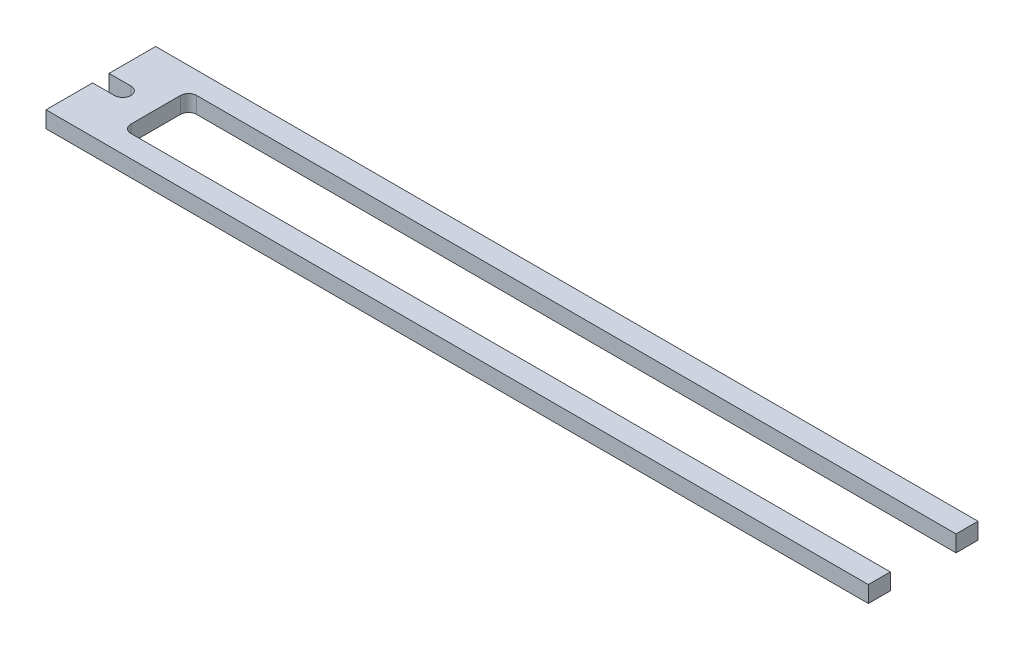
ISO-10303-21;
HEADER;
FILE_DESCRIPTION(('STEP AP214'),'2;1');
FILE_NAME('part.step','',(''),(''),'','','');
FILE_SCHEMA(('AUTOMOTIVE_DESIGN { 1 0 10303 214 1 1 1 1 }'));
ENDSEC;
DATA;
#1=APPLICATION_CONTEXT('core data for automotive mechanical design processes');
#2=APPLICATION_PROTOCOL_DEFINITION('international standard','automotive_design',2000,#1);
#3=PRODUCT_CONTEXT('',#1,'mechanical');
#4=PRODUCT('Part','Part','',(#3));
#5=PRODUCT_RELATED_PRODUCT_CATEGORY('part','',(#4));
#6=PRODUCT_DEFINITION_FORMATION('','',#4);
#7=PRODUCT_DEFINITION_CONTEXT('part definition',#1,'design');
#8=PRODUCT_DEFINITION('design','',#6,#7);
#9=PRODUCT_DEFINITION_SHAPE('','',#8);
#10=(LENGTH_UNIT() NAMED_UNIT(*) SI_UNIT(.MILLI.,.METRE.));
#11=(NAMED_UNIT(*) PLANE_ANGLE_UNIT() SI_UNIT($,.RADIAN.));
#12=(NAMED_UNIT(*) SI_UNIT($,.STERADIAN.) SOLID_ANGLE_UNIT());
#13=UNCERTAINTY_MEASURE_WITH_UNIT(LENGTH_MEASURE(1.E-05),#10,'distance_accuracy_value','');
#14=(GEOMETRIC_REPRESENTATION_CONTEXT(3) GLOBAL_UNCERTAINTY_ASSIGNED_CONTEXT((#13)) GLOBAL_UNIT_ASSIGNED_CONTEXT((#10,
#11,#12)) REPRESENTATION_CONTEXT('',''));
#15=CARTESIAN_POINT('',(0.,0.,0.));
#16=DIRECTION('',(0.,0.,1.));
#17=DIRECTION('',(1.,0.,0.));
#18=AXIS2_PLACEMENT_3D('',#15,#16,#17);
#19=CARTESIAN_POINT('',(-23.0142791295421,1.5,-5.75));
#20=DIRECTION('',(1.,0.,0.));
#21=DIRECTION('',(0.,0.,-1.));
#22=AXIS2_PLACEMENT_3D('',#19,#20,#21);
#23=PLANE('',#22);
#24=DIRECTION('',(0.,0.,1.));
#25=VECTOR('',#24,1.);
#26=CARTESIAN_POINT('',(-23.0142791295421,0.,-5.75));
#27=LINE('',#26,#25);
#28=CARTESIAN_POINT('',(-23.0142791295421,0.,-5.75));
#29=VERTEX_POINT('',#28);
#30=CARTESIAN_POINT('',(-23.0142791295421,0.,-1.5));
#31=VERTEX_POINT('',#30);
#32=EDGE_CURVE('E167',#29,#31,#27,.T.);
#33=ORIENTED_EDGE('',*,*,#32,.T.);
#34=DIRECTION('',(0.,-1.,0.));
#35=VECTOR('',#34,1.);
#36=CARTESIAN_POINT('',(-23.0142791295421,1.5,-1.5));
#37=LINE('',#36,#35);
#38=CARTESIAN_POINT('',(-23.0142791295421,1.5,-1.5));
#39=VERTEX_POINT('',#38);
#40=EDGE_CURVE('E11',#39,#31,#37,.T.);
#41=ORIENTED_EDGE('',*,*,#40,.F.);
#42=DIRECTION('',(0.,0.,1.));
#43=VECTOR('',#42,1.);
#44=CARTESIAN_POINT('',(-23.0142791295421,1.5,-5.75));
#45=LINE('',#44,#43);
#46=CARTESIAN_POINT('',(-23.0142791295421,1.5,-5.75));
#47=VERTEX_POINT('',#46);
#48=EDGE_CURVE('E193',#47,#39,#45,.T.);
#49=ORIENTED_EDGE('',*,*,#48,.F.);
#50=DIRECTION('',(0.,-1.,0.));
#51=VECTOR('',#50,1.);
#52=CARTESIAN_POINT('',(-23.0142791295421,1.5,-5.75));
#53=LINE('',#52,#51);
#54=EDGE_CURVE('E163',#47,#29,#53,.T.);
#55=ORIENTED_EDGE('',*,*,#54,.T.);
#56=EDGE_LOOP('',(#33,#41,#49,#55));
#57=FACE_BOUND('',#56,.T.);
#58=ADVANCED_FACE('F35',(#57),#23,.F.);
#59=CARTESIAN_POINT('',(-23.0142791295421,1.5,-1.5));
#60=DIRECTION('',(0.,0.,-1.));
#61=DIRECTION('',(-1.,0.,0.));
#62=AXIS2_PLACEMENT_3D('',#59,#60,#61);
#63=PLANE('',#62);
#64=DIRECTION('',(1.,0.,0.));
#65=VECTOR('',#64,1.);
#66=CARTESIAN_POINT('',(-23.0142791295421,0.,-1.5));
#67=LINE('',#66,#65);
#68=CARTESIAN_POINT('',(-21.0142791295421,0.,-1.5));
#69=VERTEX_POINT('',#68);
#70=EDGE_CURVE('E170',#31,#69,#67,.T.);
#71=ORIENTED_EDGE('',*,*,#70,.T.);
#72=DIRECTION('',(0.,-1.,0.));
#73=VECTOR('',#72,1.);
#74=CARTESIAN_POINT('',(-21.0142791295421,1.5,-1.5));
#75=LINE('',#74,#73);
#76=CARTESIAN_POINT('',(-21.0142791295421,1.5,-1.5));
#77=VERTEX_POINT('',#76);
#78=EDGE_CURVE('E43',#77,#69,#75,.T.);
#79=ORIENTED_EDGE('',*,*,#78,.F.);
#80=DIRECTION('',(1.,0.,0.));
#81=VECTOR('',#80,1.);
#82=CARTESIAN_POINT('',(-23.0142791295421,1.5,-1.5));
#83=LINE('',#82,#81);
#84=EDGE_CURVE('E112',#39,#77,#83,.T.);
#85=ORIENTED_EDGE('',*,*,#84,.F.);
#86=ORIENTED_EDGE('',*,*,#40,.T.);
#87=EDGE_LOOP('',(#71,#79,#85,#86));
#88=FACE_BOUND('',#87,.T.);
#89=ADVANCED_FACE('F281',(#88),#63,.F.);
#90=CARTESIAN_POINT('',(-21.0142791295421,1.5,-0.75));
#91=DIRECTION('',(0.,-1.,0.));
#92=DIRECTION('',(0.,0.,-1.));
#93=AXIS2_PLACEMENT_3D('',#90,#91,#92);
#94=CYLINDRICAL_SURFACE('',#93,0.75);
#95=CARTESIAN_POINT('',(-21.0142791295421,0.,-0.75));
#96=DIRECTION('',(0.,-1.,0.));
#97=DIRECTION('',(0.,0.,-1.));
#98=AXIS2_PLACEMENT_3D('',#95,#96,#97);
#99=CIRCLE('',#98,0.75);
#100=CARTESIAN_POINT('',(-21.0142791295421,0.,0.));
#101=VERTEX_POINT('',#100);
#102=EDGE_CURVE('E172',#69,#101,#99,.T.);
#103=ORIENTED_EDGE('',*,*,#102,.T.);
#104=DIRECTION('',(0.,-1.,0.));
#105=VECTOR('',#104,1.);
#106=CARTESIAN_POINT('',(-21.0142791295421,1.5,0.));
#107=LINE('',#106,#105);
#108=CARTESIAN_POINT('',(-21.0142791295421,1.5,0.));
#109=VERTEX_POINT('',#108);
#110=EDGE_CURVE('E218',#109,#101,#107,.T.);
#111=ORIENTED_EDGE('',*,*,#110,.F.);
#112=CARTESIAN_POINT('',(-21.0142791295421,1.5,-0.75));
#113=DIRECTION('',(0.,-1.,0.));
#114=DIRECTION('',(0.,0.,-1.));
#115=AXIS2_PLACEMENT_3D('',#112,#113,#114);
#116=CIRCLE('',#115,0.75);
#117=EDGE_CURVE('E226',#77,#109,#116,.T.);
#118=ORIENTED_EDGE('',*,*,#117,.F.);
#119=ORIENTED_EDGE('',*,*,#78,.T.);
#120=EDGE_LOOP('',(#103,#111,#118,#119));
#121=FACE_BOUND('',#120,.T.);
#122=ADVANCED_FACE('F224',(#121),#94,.F.);
#123=CARTESIAN_POINT('',(-21.0142791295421,1.5,0.));
#124=DIRECTION('',(0.,0.,1.));
#125=DIRECTION('',(1.,0.,0.));
#126=AXIS2_PLACEMENT_3D('',#123,#124,#125);
#127=PLANE('',#126);
#128=DIRECTION('',(-1.,0.,0.));
#129=VECTOR('',#128,1.);
#130=CARTESIAN_POINT('',(-21.0142791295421,0.,0.));
#131=LINE('',#130,#129);
#132=CARTESIAN_POINT('',(-23.0142791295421,0.,0.));
#133=VERTEX_POINT('',#132);
#134=EDGE_CURVE('E174',#101,#133,#131,.T.);
#135=ORIENTED_EDGE('',*,*,#134,.T.);
#136=DIRECTION('',(0.,-1.,0.));
#137=VECTOR('',#136,1.);
#138=CARTESIAN_POINT('',(-23.0142791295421,1.5,0.));
#139=LINE('',#138,#137);
#140=CARTESIAN_POINT('',(-23.0142791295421,1.5,0.));
#141=VERTEX_POINT('',#140);
#142=EDGE_CURVE('E215',#141,#133,#139,.T.);
#143=ORIENTED_EDGE('',*,*,#142,.F.);
#144=DIRECTION('',(-1.,0.,0.));
#145=VECTOR('',#144,1.);
#146=CARTESIAN_POINT('',(-21.0142791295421,1.5,0.));
#147=LINE('',#146,#145);
#148=EDGE_CURVE('E244',#109,#141,#147,.T.);
#149=ORIENTED_EDGE('',*,*,#148,.F.);
#150=ORIENTED_EDGE('',*,*,#110,.T.);
#151=EDGE_LOOP('',(#135,#143,#149,#150));
#152=FACE_BOUND('',#151,.T.);
#153=ADVANCED_FACE('F235',(#152),#127,.F.);
#154=CARTESIAN_POINT('',(-23.0142791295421,1.5,0.));
#155=DIRECTION('',(1.,0.,0.));
#156=DIRECTION('',(0.,0.,-1.));
#157=AXIS2_PLACEMENT_3D('',#154,#155,#156);
#158=PLANE('',#157);
#159=DIRECTION('',(0.,0.,1.));
#160=VECTOR('',#159,1.);
#161=CARTESIAN_POINT('',(-23.0142791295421,0.,0.));
#162=LINE('',#161,#160);
#163=CARTESIAN_POINT('',(-23.0142791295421,0.,4.25));
#164=VERTEX_POINT('',#163);
#165=EDGE_CURVE('E176',#133,#164,#162,.T.);
#166=ORIENTED_EDGE('',*,*,#165,.T.);
#167=DIRECTION('',(0.,-1.,0.));
#168=VECTOR('',#167,1.);
#169=CARTESIAN_POINT('',(-23.0142791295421,1.5,4.25));
#170=LINE('',#169,#168);
#171=CARTESIAN_POINT('',(-23.0142791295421,1.5,4.25));
#172=VERTEX_POINT('',#171);
#173=EDGE_CURVE('E212',#172,#164,#170,.T.);
#174=ORIENTED_EDGE('',*,*,#173,.F.);
#175=DIRECTION('',(0.,0.,1.));
#176=VECTOR('',#175,1.);
#177=CARTESIAN_POINT('',(-23.0142791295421,1.5,0.));
#178=LINE('',#177,#176);
#179=EDGE_CURVE('E241',#141,#172,#178,.T.);
#180=ORIENTED_EDGE('',*,*,#179,.F.);
#181=ORIENTED_EDGE('',*,*,#142,.T.);
#182=EDGE_LOOP('',(#166,#174,#180,#181));
#183=FACE_BOUND('',#182,.T.);
#184=ADVANCED_FACE('F239',(#183),#158,.F.);
#185=CARTESIAN_POINT('',(-23.0142791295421,1.5,4.25));
#186=DIRECTION('',(0.,0.,-1.));
#187=DIRECTION('',(-1.,0.,0.));
#188=AXIS2_PLACEMENT_3D('',#185,#186,#187);
#189=PLANE('',#188);
#190=DIRECTION('',(1.,0.,0.));
#191=VECTOR('',#190,1.);
#192=CARTESIAN_POINT('',(-23.0142791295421,0.,4.25));
#193=LINE('',#192,#191);
#194=CARTESIAN_POINT('',(51.9857208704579,0.,4.25));
#195=VERTEX_POINT('',#194);
#196=EDGE_CURVE('E178',#164,#195,#193,.T.);
#197=ORIENTED_EDGE('',*,*,#196,.T.);
#198=DIRECTION('',(0.,-1.,0.));
#199=VECTOR('',#198,1.);
#200=CARTESIAN_POINT('',(51.9857208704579,1.5,4.25));
#201=LINE('',#200,#199);
#202=CARTESIAN_POINT('',(51.9857208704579,1.5,4.25));
#203=VERTEX_POINT('',#202);
#204=EDGE_CURVE('E209',#203,#195,#201,.T.);
#205=ORIENTED_EDGE('',*,*,#204,.F.);
#206=DIRECTION('',(1.,0.,0.));
#207=VECTOR('',#206,1.);
#208=CARTESIAN_POINT('',(-23.0142791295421,1.5,4.25));
#209=LINE('',#208,#207);
#210=EDGE_CURVE('E243',#172,#203,#209,.T.);
#211=ORIENTED_EDGE('',*,*,#210,.F.);
#212=ORIENTED_EDGE('',*,*,#173,.T.);
#213=EDGE_LOOP('',(#197,#205,#211,#212));
#214=FACE_BOUND('',#213,.T.);
#215=ADVANCED_FACE('F294',(#214),#189,.F.);
#216=CARTESIAN_POINT('',(51.9857208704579,1.5,2.25));
#217=DIRECTION('',(-1.,0.,0.));
#218=DIRECTION('',(0.,0.,1.));
#219=AXIS2_PLACEMENT_3D('',#216,#217,#218);
#220=PLANE('',#219);
#221=DIRECTION('',(0.,0.,-1.));
#222=VECTOR('',#221,1.);
#223=CARTESIAN_POINT('',(51.9857208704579,0.,2.25));
#224=LINE('',#223,#222);
#225=CARTESIAN_POINT('',(51.9857208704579,0.,2.25));
#226=VERTEX_POINT('',#225);
#227=EDGE_CURVE('E180',#195,#226,#224,.T.);
#228=ORIENTED_EDGE('',*,*,#227,.T.);
#229=DIRECTION('',(0.,-1.,0.));
#230=VECTOR('',#229,1.);
#231=CARTESIAN_POINT('',(51.9857208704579,1.5,2.25));
#232=LINE('',#231,#230);
#233=CARTESIAN_POINT('',(51.9857208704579,1.5,2.25));
#234=VERTEX_POINT('',#233);
#235=EDGE_CURVE('E206',#234,#226,#232,.T.);
#236=ORIENTED_EDGE('',*,*,#235,.F.);
#237=DIRECTION('',(0.,0.,-1.));
#238=VECTOR('',#237,1.);
#239=CARTESIAN_POINT('',(51.9857208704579,1.5,2.25));
#240=LINE('',#239,#238);
#241=EDGE_CURVE('E246',#203,#234,#240,.T.);
#242=ORIENTED_EDGE('',*,*,#241,.F.);
#243=ORIENTED_EDGE('',*,*,#204,.T.);
#244=EDGE_LOOP('',(#228,#236,#242,#243));
#245=FACE_BOUND('',#244,.T.);
#246=ADVANCED_FACE('F297',(#245),#220,.F.);
#247=CARTESIAN_POINT('',(51.9857208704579,1.5,2.25));
#248=DIRECTION('',(0.,0.,1.));
#249=DIRECTION('',(1.,0.,0.));
#250=AXIS2_PLACEMENT_3D('',#247,#248,#249);
#251=PLANE('',#250);
#252=DIRECTION('',(-1.,0.,0.));
#253=VECTOR('',#252,1.);
#254=CARTESIAN_POINT('',(51.9857208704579,0.,2.25));
#255=LINE('',#254,#253);
#256=CARTESIAN_POINT('',(-17.274279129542,0.,2.25000000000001));
#257=VERTEX_POINT('',#256);
#258=EDGE_CURVE('E182',#226,#257,#255,.T.);
#259=ORIENTED_EDGE('',*,*,#258,.T.);
#260=DIRECTION('',(0.,-1.,0.));
#261=VECTOR('',#260,1.);
#262=CARTESIAN_POINT('',(-17.274279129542,1.5,2.25000000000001));
#263=LINE('',#262,#261);
#264=CARTESIAN_POINT('',(-17.274279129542,1.5,2.25000000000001));
#265=VERTEX_POINT('',#264);
#266=EDGE_CURVE('E203',#265,#257,#263,.T.);
#267=ORIENTED_EDGE('',*,*,#266,.F.);
#268=DIRECTION('',(-1.,0.,0.));
#269=VECTOR('',#268,1.);
#270=CARTESIAN_POINT('',(51.9857208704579,1.5,2.25));
#271=LINE('',#270,#269);
#272=EDGE_CURVE('E252',#234,#265,#271,.T.);
#273=ORIENTED_EDGE('',*,*,#272,.F.);
#274=ORIENTED_EDGE('',*,*,#235,.T.);
#275=EDGE_LOOP('',(#259,#267,#273,#274));
#276=FACE_BOUND('',#275,.T.);
#277=ADVANCED_FACE('F301',(#276),#251,.F.);
#278=CARTESIAN_POINT('',(-17.274279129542,1.5,1.51000000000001));
#279=DIRECTION('',(0.,-1.,0.));
#280=DIRECTION('',(0.,0.,-1.));
#281=AXIS2_PLACEMENT_3D('',#278,#279,#280);
#282=CYLINDRICAL_SURFACE('',#281,0.740000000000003);
#283=CARTESIAN_POINT('',(-17.274279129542,0.,1.51000000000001));
#284=DIRECTION('',(0.,-1.,0.));
#285=DIRECTION('',(0.,0.,-1.));
#286=AXIS2_PLACEMENT_3D('',#283,#284,#285);
#287=CIRCLE('',#286,0.740000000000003);
#288=CARTESIAN_POINT('',(-18.0142791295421,0.,1.51000000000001));
#289=VERTEX_POINT('',#288);
#290=EDGE_CURVE('E184',#257,#289,#287,.T.);
#291=ORIENTED_EDGE('',*,*,#290,.T.);
#292=DIRECTION('',(0.,-1.,0.));
#293=VECTOR('',#292,1.);
#294=CARTESIAN_POINT('',(-18.0142791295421,1.5,1.51000000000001));
#295=LINE('',#294,#293);
#296=CARTESIAN_POINT('',(-18.0142791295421,1.5,1.51000000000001));
#297=VERTEX_POINT('',#296);
#298=EDGE_CURVE('E200',#297,#289,#295,.T.);
#299=ORIENTED_EDGE('',*,*,#298,.F.);
#300=CARTESIAN_POINT('',(-17.274279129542,1.5,1.51000000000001));
#301=DIRECTION('',(0.,-1.,0.));
#302=DIRECTION('',(0.,0.,-1.));
#303=AXIS2_PLACEMENT_3D('',#300,#301,#302);
#304=CIRCLE('',#303,0.740000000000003);
#305=EDGE_CURVE('E254',#265,#297,#304,.T.);
#306=ORIENTED_EDGE('',*,*,#305,.F.);
#307=ORIENTED_EDGE('',*,*,#266,.T.);
#308=EDGE_LOOP('',(#291,#299,#306,#307));
#309=FACE_BOUND('',#308,.T.);
#310=ADVANCED_FACE('F305',(#309),#282,.F.);
#311=CARTESIAN_POINT('',(-18.014279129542,1.5,-3.00999999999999));
#312=DIRECTION('',(-1.,0.,0.));
#313=DIRECTION('',(0.,0.,1.));
#314=AXIS2_PLACEMENT_3D('',#311,#312,#313);
#315=PLANE('',#314);
#316=DIRECTION('',(0.,0.,-1.));
#317=VECTOR('',#316,1.);
#318=CARTESIAN_POINT('',(-18.014279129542,0.,-3.00999999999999));
#319=LINE('',#318,#317);
#320=CARTESIAN_POINT('',(-18.014279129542,0.,-3.00999999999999));
#321=VERTEX_POINT('',#320);
#322=EDGE_CURVE('E186',#289,#321,#319,.T.);
#323=ORIENTED_EDGE('',*,*,#322,.T.);
#324=DIRECTION('',(0.,-1.,0.));
#325=VECTOR('',#324,1.);
#326=CARTESIAN_POINT('',(-18.014279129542,1.5,-3.00999999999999));
#327=LINE('',#326,#325);
#328=CARTESIAN_POINT('',(-18.014279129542,1.5,-3.00999999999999));
#329=VERTEX_POINT('',#328);
#330=EDGE_CURVE('E197',#329,#321,#327,.T.);
#331=ORIENTED_EDGE('',*,*,#330,.F.);
#332=DIRECTION('',(0.,0.,-1.));
#333=VECTOR('',#332,1.);
#334=CARTESIAN_POINT('',(-18.014279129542,1.5,-3.00999999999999));
#335=LINE('',#334,#333);
#336=EDGE_CURVE('E256',#297,#329,#335,.T.);
#337=ORIENTED_EDGE('',*,*,#336,.F.);
#338=ORIENTED_EDGE('',*,*,#298,.T.);
#339=EDGE_LOOP('',(#323,#331,#337,#338));
#340=FACE_BOUND('',#339,.T.);
#341=ADVANCED_FACE('F262',(#340),#315,.F.);
#342=CARTESIAN_POINT('',(-17.274279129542,1.5,-3.00999999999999));
#343=DIRECTION('',(0.,-1.,0.));
#344=DIRECTION('',(0.,0.,-1.));
#345=AXIS2_PLACEMENT_3D('',#342,#343,#344);
#346=CYLINDRICAL_SURFACE('',#345,0.740000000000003);
#347=CARTESIAN_POINT('',(-17.274279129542,0.,-3.00999999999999));
#348=DIRECTION('',(0.,-1.,0.));
#349=DIRECTION('',(0.,0.,1.));
#350=AXIS2_PLACEMENT_3D('',#347,#348,#349);
#351=CIRCLE('',#350,0.740000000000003);
#352=CARTESIAN_POINT('',(-17.274279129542,0.,-3.74999999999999));
#353=VERTEX_POINT('',#352);
#354=EDGE_CURVE('E188',#321,#353,#351,.T.);
#355=ORIENTED_EDGE('',*,*,#354,.T.);
#356=DIRECTION('',(0.,-1.,0.));
#357=VECTOR('',#356,1.);
#358=CARTESIAN_POINT('',(-17.274279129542,1.5,-3.74999999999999));
#359=LINE('',#358,#357);
#360=CARTESIAN_POINT('',(-17.274279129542,1.5,-3.74999999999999));
#361=VERTEX_POINT('',#360);
#362=EDGE_CURVE('E158',#361,#353,#359,.T.);
#363=ORIENTED_EDGE('',*,*,#362,.F.);
#364=CARTESIAN_POINT('',(-17.274279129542,1.5,-3.00999999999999));
#365=DIRECTION('',(0.,-1.,0.));
#366=DIRECTION('',(0.,0.,1.));
#367=AXIS2_PLACEMENT_3D('',#364,#365,#366);
#368=CIRCLE('',#367,0.740000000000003);
#369=EDGE_CURVE('E149',#329,#361,#368,.T.);
#370=ORIENTED_EDGE('',*,*,#369,.F.);
#371=ORIENTED_EDGE('',*,*,#330,.T.);
#372=EDGE_LOOP('',(#355,#363,#370,#371));
#373=FACE_BOUND('',#372,.T.);
#374=ADVANCED_FACE('F266',(#373),#346,.F.);
#375=CARTESIAN_POINT('',(51.9857208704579,1.5,-3.75));
#376=DIRECTION('',(0.,0.,-1.));
#377=DIRECTION('',(-1.,0.,0.));
#378=AXIS2_PLACEMENT_3D('',#375,#376,#377);
#379=PLANE('',#378);
#380=DIRECTION('',(1.,0.,0.));
#381=VECTOR('',#380,1.);
#382=CARTESIAN_POINT('',(51.9857208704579,0.,-3.75));
#383=LINE('',#382,#381);
#384=CARTESIAN_POINT('',(51.9857208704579,0.,-3.75));
#385=VERTEX_POINT('',#384);
#386=EDGE_CURVE('E157',#353,#385,#383,.T.);
#387=ORIENTED_EDGE('',*,*,#386,.T.);
#388=DIRECTION('',(0.,-1.,0.));
#389=VECTOR('',#388,1.);
#390=CARTESIAN_POINT('',(51.9857208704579,1.5,-3.75));
#391=LINE('',#390,#389);
#392=CARTESIAN_POINT('',(51.9857208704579,1.5,-3.75));
#393=VERTEX_POINT('',#392);
#394=EDGE_CURVE('E154',#393,#385,#391,.T.);
#395=ORIENTED_EDGE('',*,*,#394,.F.);
#396=DIRECTION('',(1.,0.,0.));
#397=VECTOR('',#396,1.);
#398=CARTESIAN_POINT('',(51.9857208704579,1.5,-3.75));
#399=LINE('',#398,#397);
#400=EDGE_CURVE('E143',#361,#393,#399,.T.);
#401=ORIENTED_EDGE('',*,*,#400,.F.);
#402=ORIENTED_EDGE('',*,*,#362,.T.);
#403=EDGE_LOOP('',(#387,#395,#401,#402));
#404=FACE_BOUND('',#403,.T.);
#405=ADVANCED_FACE('F155',(#404),#379,.F.);
#406=CARTESIAN_POINT('',(51.9857208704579,1.5,-5.75));
#407=DIRECTION('',(-1.,0.,0.));
#408=DIRECTION('',(0.,0.,1.));
#409=AXIS2_PLACEMENT_3D('',#406,#407,#408);
#410=PLANE('',#409);
#411=DIRECTION('',(0.,0.,-1.));
#412=VECTOR('',#411,1.);
#413=CARTESIAN_POINT('',(51.9857208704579,0.,-5.75));
#414=LINE('',#413,#412);
#415=CARTESIAN_POINT('',(51.9857208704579,0.,-5.75));
#416=VERTEX_POINT('',#415);
#417=EDGE_CURVE('E98',#385,#416,#414,.T.);
#418=ORIENTED_EDGE('',*,*,#417,.T.);
#419=DIRECTION('',(0.,-1.,0.));
#420=VECTOR('',#419,1.);
#421=CARTESIAN_POINT('',(51.9857208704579,1.5,-5.75));
#422=LINE('',#421,#420);
#423=CARTESIAN_POINT('',(51.9857208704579,1.5,-5.75));
#424=VERTEX_POINT('',#423);
#425=EDGE_CURVE('E159',#424,#416,#422,.T.);
#426=ORIENTED_EDGE('',*,*,#425,.F.);
#427=DIRECTION('',(0.,0.,-1.));
#428=VECTOR('',#427,1.);
#429=CARTESIAN_POINT('',(51.9857208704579,1.5,-5.75));
#430=LINE('',#429,#428);
#431=EDGE_CURVE('E147',#393,#424,#430,.T.);
#432=ORIENTED_EDGE('',*,*,#431,.F.);
#433=ORIENTED_EDGE('',*,*,#394,.T.);
#434=EDGE_LOOP('',(#418,#426,#432,#433));
#435=FACE_BOUND('',#434,.T.);
#436=ADVANCED_FACE('F161',(#435),#410,.F.);
#437=CARTESIAN_POINT('',(-23.0142791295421,1.5,-5.75));
#438=DIRECTION('',(0.,0.,1.));
#439=DIRECTION('',(1.,0.,0.));
#440=AXIS2_PLACEMENT_3D('',#437,#438,#439);
#441=PLANE('',#440);
#442=DIRECTION('',(-1.,0.,0.));
#443=VECTOR('',#442,1.);
#444=CARTESIAN_POINT('',(-23.0142791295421,0.,-5.75));
#445=LINE('',#444,#443);
#446=EDGE_CURVE('E104',#416,#29,#445,.T.);
#447=ORIENTED_EDGE('',*,*,#446,.T.);
#448=ORIENTED_EDGE('',*,*,#54,.F.);
#449=DIRECTION('',(-1.,0.,0.));
#450=VECTOR('',#449,1.);
#451=CARTESIAN_POINT('',(-23.0142791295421,1.5,-5.75));
#452=LINE('',#451,#450);
#453=EDGE_CURVE('E51',#424,#47,#452,.T.);
#454=ORIENTED_EDGE('',*,*,#453,.F.);
#455=ORIENTED_EDGE('',*,*,#425,.T.);
#456=EDGE_LOOP('',(#447,#448,#454,#455));
#457=FACE_BOUND('',#456,.T.);
#458=ADVANCED_FACE('F270',(#457),#441,.F.);
#459=CARTESIAN_POINT('',(-21.0142791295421,1.5,-0.75));
#460=DIRECTION('',(0.,-1.,0.));
#461=DIRECTION('',(0.,0.,-1.));
#462=AXIS2_PLACEMENT_3D('',#459,#460,#461);
#463=PLANE('',#462);
#464=ORIENTED_EDGE('',*,*,#48,.T.);
#465=ORIENTED_EDGE('',*,*,#84,.T.);
#466=ORIENTED_EDGE('',*,*,#117,.T.);
#467=ORIENTED_EDGE('',*,*,#148,.T.);
#468=ORIENTED_EDGE('',*,*,#179,.T.);
#469=ORIENTED_EDGE('',*,*,#210,.T.);
#470=ORIENTED_EDGE('',*,*,#241,.T.);
#471=ORIENTED_EDGE('',*,*,#272,.T.);
#472=ORIENTED_EDGE('',*,*,#305,.T.);
#473=ORIENTED_EDGE('',*,*,#336,.T.);
#474=ORIENTED_EDGE('',*,*,#369,.T.);
#475=ORIENTED_EDGE('',*,*,#400,.T.);
#476=ORIENTED_EDGE('',*,*,#431,.T.);
#477=ORIENTED_EDGE('',*,*,#453,.T.);
#478=EDGE_LOOP('',(#464,#465,#466,#467,#468,#469,#470,#471,#472,#473,#474,#475,#476,#477));
#479=FACE_BOUND('',#478,.T.);
#480=ADVANCED_FACE('F145',(#479),#463,.F.);
#481=CARTESIAN_POINT('',(-21.0142791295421,0.,-0.75));
#482=DIRECTION('',(0.,-1.,0.));
#483=DIRECTION('',(0.,0.,-1.));
#484=AXIS2_PLACEMENT_3D('',#481,#482,#483);
#485=PLANE('',#484);
#486=ORIENTED_EDGE('',*,*,#32,.F.);
#487=ORIENTED_EDGE('',*,*,#446,.F.);
#488=ORIENTED_EDGE('',*,*,#417,.F.);
#489=ORIENTED_EDGE('',*,*,#386,.F.);
#490=ORIENTED_EDGE('',*,*,#354,.F.);
#491=ORIENTED_EDGE('',*,*,#322,.F.);
#492=ORIENTED_EDGE('',*,*,#290,.F.);
#493=ORIENTED_EDGE('',*,*,#258,.F.);
#494=ORIENTED_EDGE('',*,*,#227,.F.);
#495=ORIENTED_EDGE('',*,*,#196,.F.);
#496=ORIENTED_EDGE('',*,*,#165,.F.);
#497=ORIENTED_EDGE('',*,*,#134,.F.);
#498=ORIENTED_EDGE('',*,*,#102,.F.);
#499=ORIENTED_EDGE('',*,*,#70,.F.);
#500=EDGE_LOOP('',(#486,#487,#488,#489,#490,#491,#492,#493,#494,#495,#496,#497,#498,#499));
#501=FACE_BOUND('',#500,.T.);
#502=ADVANCED_FACE('F230',(#501),#485,.T.);
#503=CLOSED_SHELL('',(#58,#89,#122,#153,#184,#215,#246,#277,#310,#341,#374,#405,#436,#458,#480,#502));
#504=MANIFOLD_SOLID_BREP('B2',#503);
#505=ADVANCED_BREP_SHAPE_REPRESENTATION('',(#18,#504),#14);
#506=SHAPE_DEFINITION_REPRESENTATION(#9,#505);
ENDSEC;
END-ISO-10303-21;
